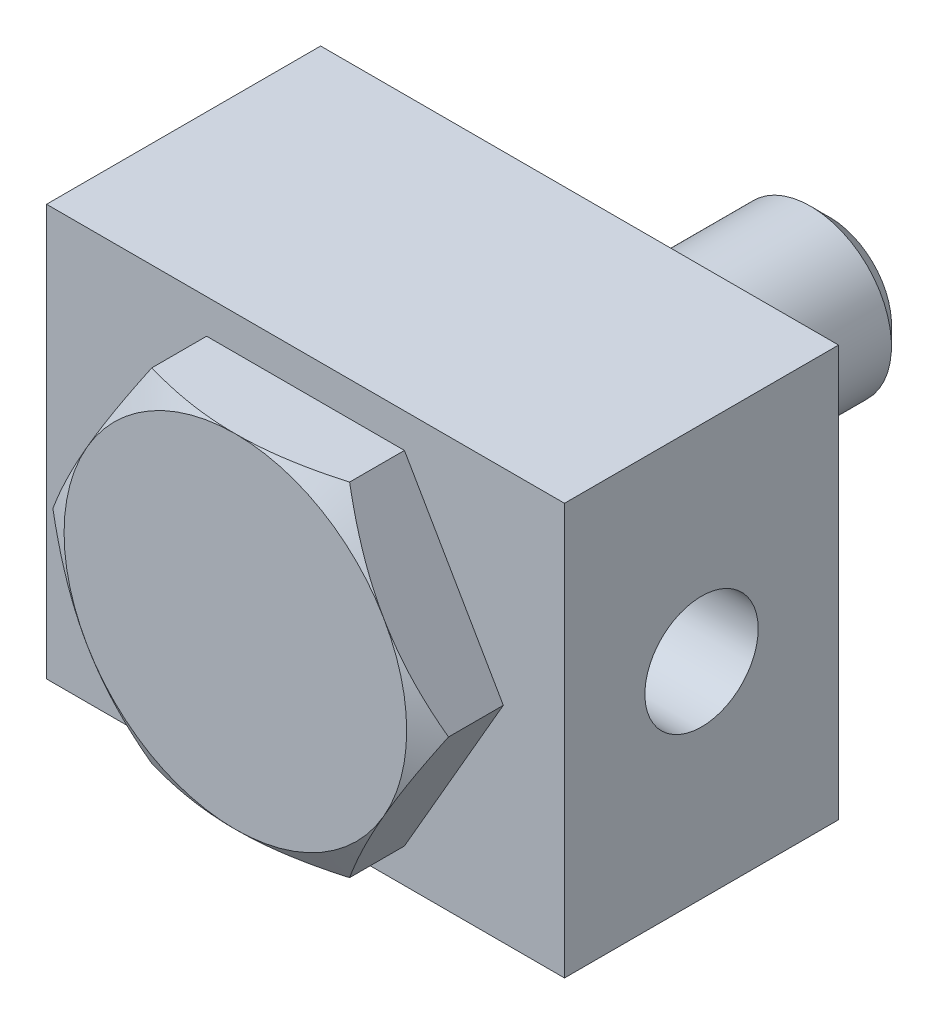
ISO-10303-21;
HEADER;
FILE_DESCRIPTION(('STEP AP214'),'2;1');
FILE_NAME('part.step','',(''),(''),'','','');
FILE_SCHEMA(('AUTOMOTIVE_DESIGN { 1 0 10303 214 1 1 1 1 }'));
ENDSEC;
DATA;
#1=APPLICATION_CONTEXT('core data for automotive mechanical design processes');
#2=APPLICATION_PROTOCOL_DEFINITION('international standard','automotive_design',2000,#1);
#3=PRODUCT_CONTEXT('',#1,'mechanical');
#4=PRODUCT('Part','Part','',(#3));
#5=PRODUCT_RELATED_PRODUCT_CATEGORY('part','',(#4));
#6=PRODUCT_DEFINITION_FORMATION('','',#4);
#7=PRODUCT_DEFINITION_CONTEXT('part definition',#1,'design');
#8=PRODUCT_DEFINITION('design','',#6,#7);
#9=PRODUCT_DEFINITION_SHAPE('','',#8);
#10=(LENGTH_UNIT() NAMED_UNIT(*) SI_UNIT(.MILLI.,.METRE.));
#11=(NAMED_UNIT(*) PLANE_ANGLE_UNIT() SI_UNIT($,.RADIAN.));
#12=(NAMED_UNIT(*) SI_UNIT($,.STERADIAN.) SOLID_ANGLE_UNIT());
#13=UNCERTAINTY_MEASURE_WITH_UNIT(LENGTH_MEASURE(1.E-05),#10,'distance_accuracy_value','');
#14=(GEOMETRIC_REPRESENTATION_CONTEXT(3) GLOBAL_UNCERTAINTY_ASSIGNED_CONTEXT((#13)) GLOBAL_UNIT_ASSIGNED_CONTEXT((#10,
#11,#12)) REPRESENTATION_CONTEXT('',''));
#15=CARTESIAN_POINT('',(0.,0.,0.));
#16=DIRECTION('',(0.,0.,1.));
#17=DIRECTION('',(1.,0.,0.));
#18=AXIS2_PLACEMENT_3D('',#15,#16,#17);
#19=CARTESIAN_POINT('',(-18.3308710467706,31.75,70.3));
#20=DIRECTION('',(0.866025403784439,-0.5,0.));
#21=DIRECTION('',(0.5,0.866025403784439,0.));
#22=AXIS2_PLACEMENT_3D('',#19,#20,#21);
#23=PLANE('',#22);
#24=CARTESIAN_POINT('',(-18.3307555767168,31.7502,62.4641377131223));
#25=CARTESIAN_POINT('',(-18.7336598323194,31.0523493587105,62.6967369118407));
#26=CARTESIAN_POINT('',(-19.13813562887,30.3517767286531,62.9187809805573));
#27=CARTESIAN_POINT('',(-19.9503306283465,28.9450137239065,63.3388249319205));
#28=CARTESIAN_POINT('',(-20.358050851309,28.238821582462,63.5368169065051));
#29=CARTESIAN_POINT('',(-21.1775313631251,26.8194397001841,63.906099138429));
#30=CARTESIAN_POINT('',(-21.5892988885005,26.1062374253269,64.0773256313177));
#31=CARTESIAN_POINT('',(-22.4156776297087,24.6749074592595,64.3893882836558));
#32=CARTESIAN_POINT('',(-22.8302885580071,23.9567802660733,64.5302274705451));
#33=CARTESIAN_POINT('',(-23.6517563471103,22.5339563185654,64.7755371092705));
#34=CARTESIAN_POINT('',(-24.0585522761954,21.8293651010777,64.8808188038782));
#35=CARTESIAN_POINT('',(-24.8740080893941,20.4169542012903,65.0573518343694));
#36=CARTESIAN_POINT('',(-25.2826680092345,19.7091344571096,65.1286025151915));
#37=CARTESIAN_POINT('',(-26.100674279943,18.2923060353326,65.2352744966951));
#38=CARTESIAN_POINT('',(-26.5100192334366,17.5832997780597,65.2707383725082));
#39=CARTESIAN_POINT('',(-27.3290869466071,16.1646328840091,65.3050740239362));
#40=CARTESIAN_POINT('',(-27.7388096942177,15.4549722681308,65.3039469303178));
#41=CARTESIAN_POINT('',(-28.5047899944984,14.1282554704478,65.2676569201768));
#42=CARTESIAN_POINT('',(-28.8611021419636,13.5111047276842,65.2369192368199));
#43=CARTESIAN_POINT('',(-29.5728766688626,12.2782750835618,65.1483534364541));
#44=CARTESIAN_POINT('',(-29.9283390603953,11.6625961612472,65.0905257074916));
#45=CARTESIAN_POINT('',(-30.6382785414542,10.4329449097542,64.9487854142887));
#46=CARTESIAN_POINT('',(-30.9927544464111,9.81897463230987,64.8648492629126));
#47=CARTESIAN_POINT('',(-31.7000213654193,8.59395239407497,64.6723649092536));
#48=CARTESIAN_POINT('',(-32.0528123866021,7.98290042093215,64.5638168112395));
#49=CARTESIAN_POINT('',(-32.7641994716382,6.75074184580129,64.3211744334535));
#50=CARTESIAN_POINT('',(-33.1227517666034,6.12971105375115,64.186569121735));
#51=CARTESIAN_POINT('',(-33.8376618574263,4.89145045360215,63.895403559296));
#52=CARTESIAN_POINT('',(-34.1940193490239,4.27422117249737,63.7388403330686));
#53=CARTESIAN_POINT('',(-34.9037042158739,3.04501092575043,63.4061282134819));
#54=CARTESIAN_POINT('',(-35.2570361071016,2.43302213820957,63.2300176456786));
#55=CARTESIAN_POINT('',(-35.9612560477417,1.21327742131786,62.8599677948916));
#56=CARTESIAN_POINT('',(-36.3121447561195,0.605520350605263,62.6660335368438));
#57=CARTESIAN_POINT('',(-36.6618575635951,-0.000200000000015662,62.4641377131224));
#58=B_SPLINE_CURVE_WITH_KNOTS('',3,(#24,#25,#26,#27,#28,#29,#30,#31,#32,#33,#34,#35,#36,#37,#38,
#39,#40,#41,#42,#43,#44,#45,#46,#47,#48,#49,#50,#51,#52,#53,#54,#55,#56,#57),.UNSPECIFIED.,.F.,
.F.,(4,2,2,2,2,2,2,2,2,2,2,2,2,2,2,2,4),(0.,2.51618738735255,5.03319984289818,7.55612017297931,
10.078789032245,12.5392457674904,14.999749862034,17.4573232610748,19.9148207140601,
22.0541658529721,24.1934803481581,26.3347332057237,28.4759769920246,30.6644883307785,
32.8532965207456,35.0378865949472,37.2218626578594),.UNSPECIFIED.);
#59=CARTESIAN_POINT('',(-18.3308710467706,31.75,62.464204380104));
#60=VERTEX_POINT('',#59);
#61=CARTESIAN_POINT('',(-27.496306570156,15.875,65.3));
#62=VERTEX_POINT('',#61);
#63=EDGE_CURVE('E110',#60,#62,#58,.T.);
#64=ORIENTED_EDGE('',*,*,#63,.F.);
#65=DIRECTION('',(0.,0.,-1.));
#66=VECTOR('',#65,1.);
#67=CARTESIAN_POINT('',(-18.3308710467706,31.75,70.3));
#68=LINE('',#67,#66);
#69=CARTESIAN_POINT('',(-18.3308710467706,31.75,52.3));
#70=VERTEX_POINT('',#69);
#71=EDGE_CURVE('E387',#60,#70,#68,.T.);
#72=ORIENTED_EDGE('',*,*,#71,.T.);
#73=DIRECTION('',(-0.5,-0.866025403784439,0.));
#74=VECTOR('',#73,1.);
#75=CARTESIAN_POINT('',(-18.3308710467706,31.75,52.3));
#76=LINE('',#75,#74);
#77=CARTESIAN_POINT('',(-36.6617420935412,0.,52.3));
#78=VERTEX_POINT('',#77);
#79=EDGE_CURVE('E119',#70,#78,#76,.T.);
#80=ORIENTED_EDGE('',*,*,#79,.T.);
#81=DIRECTION('',(0.,0.,-1.));
#82=VECTOR('',#81,1.);
#83=CARTESIAN_POINT('',(-36.6617420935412,0.,70.3));
#84=LINE('',#83,#82);
#85=CARTESIAN_POINT('',(-36.6617420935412,0.,62.464204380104));
#86=VERTEX_POINT('',#85);
#87=EDGE_CURVE('E138',#86,#78,#84,.T.);
#88=ORIENTED_EDGE('',*,*,#87,.F.);
#89=EDGE_CURVE('E120',#62,#86,#58,.T.);
#90=ORIENTED_EDGE('',*,*,#89,.F.);
#91=EDGE_LOOP('',(#64,#72,#80,#88,#90));
#92=FACE_BOUND('',#91,.T.);
#93=ADVANCED_FACE('F16',(#92),#23,.F.);
#94=CARTESIAN_POINT('',(-36.6617420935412,0.,70.3));
#95=DIRECTION('',(0.866025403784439,0.5,0.));
#96=DIRECTION('',(-0.5,0.866025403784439,0.));
#97=AXIS2_PLACEMENT_3D('',#94,#95,#96);
#98=PLANE('',#97);
#99=CARTESIAN_POINT('',(-36.6618575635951,0.000199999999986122,62.4641377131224));
#100=CARTESIAN_POINT('',(-36.2589533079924,-0.69765064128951,62.6967369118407));
#101=CARTESIAN_POINT('',(-35.8544775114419,-1.39822327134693,62.9187809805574));
#102=CARTESIAN_POINT('',(-35.0422825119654,-2.80498627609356,63.3388249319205));
#103=CARTESIAN_POINT('',(-34.6345622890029,-3.51117841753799,63.5368169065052));
#104=CARTESIAN_POINT('',(-33.8150817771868,-4.93056029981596,63.906099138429));
#105=CARTESIAN_POINT('',(-33.4033142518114,-5.64376257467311,64.0773256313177));
#106=CARTESIAN_POINT('',(-32.5769355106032,-7.07509254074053,64.3893882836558));
#107=CARTESIAN_POINT('',(-32.1623245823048,-7.79321973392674,64.5302274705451));
#108=CARTESIAN_POINT('',(-31.3408567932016,-9.21604368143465,64.7755371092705));
#109=CARTESIAN_POINT('',(-30.9340608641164,-9.92063489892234,64.8808188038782));
#110=CARTESIAN_POINT('',(-30.1186050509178,-11.3330457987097,65.0573518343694));
#111=CARTESIAN_POINT('',(-29.7099451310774,-12.0408655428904,65.1286025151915));
#112=CARTESIAN_POINT('',(-28.8919388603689,-13.4576939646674,65.2352744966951));
#113=CARTESIAN_POINT('',(-28.4825939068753,-14.1667002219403,65.2707383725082));
#114=CARTESIAN_POINT('',(-27.6635261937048,-15.5853671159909,65.3050740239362));
#115=CARTESIAN_POINT('',(-27.2538034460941,-16.2950277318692,65.3039469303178));
#116=CARTESIAN_POINT('',(-26.4878231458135,-17.6217445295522,65.2676569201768));
#117=CARTESIAN_POINT('',(-26.1315109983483,-18.2388952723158,65.2369192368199));
#118=CARTESIAN_POINT('',(-25.4197364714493,-19.4717249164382,65.1483534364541));
#119=CARTESIAN_POINT('',(-25.0642740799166,-20.0874038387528,65.0905257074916));
#120=CARTESIAN_POINT('',(-24.3543345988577,-21.3170550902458,64.9487854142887));
#121=CARTESIAN_POINT('',(-23.9998586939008,-21.9310253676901,64.8648492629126));
#122=CARTESIAN_POINT('',(-23.2925917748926,-23.156047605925,64.6723649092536));
#123=CARTESIAN_POINT('',(-22.9398007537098,-23.7670995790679,64.5638168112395));
#124=CARTESIAN_POINT('',(-22.2284136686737,-24.9992581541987,64.3211744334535));
#125=CARTESIAN_POINT('',(-21.8698613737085,-25.6202889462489,64.1865691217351));
#126=CARTESIAN_POINT('',(-21.1549512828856,-26.8585495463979,63.895403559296));
#127=CARTESIAN_POINT('',(-20.798593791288,-27.4757788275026,63.7388403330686));
#128=CARTESIAN_POINT('',(-20.088908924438,-28.7049890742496,63.4061282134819));
#129=CARTESIAN_POINT('',(-19.7355770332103,-29.3169778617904,63.2300176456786));
#130=CARTESIAN_POINT('',(-19.0313570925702,-30.5367225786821,62.8599677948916));
#131=CARTESIAN_POINT('',(-18.6804683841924,-31.1444796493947,62.6660335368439));
#132=CARTESIAN_POINT('',(-18.3307555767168,-31.7502,62.4641377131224));
#133=B_SPLINE_CURVE_WITH_KNOTS('',3,(#99,#100,#101,#102,#103,#104,#105,#106,#107,#108,#109,#110,
#111,#112,#113,#114,#115,#116,#117,#118,#119,#120,#121,#122,#123,#124,#125,#126,#127,#128,#129,
#130,#131,#132),.UNSPECIFIED.,.F.,.F.,(4,2,2,2,2,2,2,2,2,2,2,2,2,2,2,2,4),(0.,2.51618738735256,
5.03319984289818,7.5561201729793,10.078789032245,12.5392457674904,14.999749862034,
17.4573232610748,19.9148207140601,22.054165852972,24.193480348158,26.3347332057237,
28.4759769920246,30.6644883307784,32.8532965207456,35.0378865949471,37.2218626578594),.UNSPECIFIED.);
#134=CARTESIAN_POINT('',(-27.496306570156,-15.875,65.3));
#135=VERTEX_POINT('',#134);
#136=EDGE_CURVE('E127',#86,#135,#133,.T.);
#137=ORIENTED_EDGE('',*,*,#136,.F.);
#138=ORIENTED_EDGE('',*,*,#87,.T.);
#139=DIRECTION('',(0.5,-0.866025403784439,0.));
#140=VECTOR('',#139,1.);
#141=CARTESIAN_POINT('',(-36.6617420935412,0.,52.3));
#142=LINE('',#141,#140);
#143=CARTESIAN_POINT('',(-18.3308710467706,-31.75,52.3));
#144=VERTEX_POINT('',#143);
#145=EDGE_CURVE('E395',#78,#144,#142,.T.);
#146=ORIENTED_EDGE('',*,*,#145,.T.);
#147=DIRECTION('',(0.,0.,-1.));
#148=VECTOR('',#147,1.);
#149=CARTESIAN_POINT('',(-18.3308710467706,-31.75,70.3));
#150=LINE('',#149,#148);
#151=CARTESIAN_POINT('',(-18.3308710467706,-31.75,62.464204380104));
#152=VERTEX_POINT('',#151);
#153=EDGE_CURVE('E216',#152,#144,#150,.T.);
#154=ORIENTED_EDGE('',*,*,#153,.F.);
#155=EDGE_CURVE('E139',#135,#152,#133,.T.);
#156=ORIENTED_EDGE('',*,*,#155,.F.);
#157=EDGE_LOOP('',(#137,#138,#146,#154,#156));
#158=FACE_BOUND('',#157,.T.);
#159=ADVANCED_FACE('F202',(#158),#98,.F.);
#160=CARTESIAN_POINT('',(-18.3308710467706,-31.75,70.3));
#161=DIRECTION('',(0.,1.,0.));
#162=DIRECTION('',(-1.,0.,0.));
#163=AXIS2_PLACEMENT_3D('',#160,#161,#162);
#164=PLANE('',#163);
#165=CARTESIAN_POINT('',(-49.0609987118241,-31.75,49.8914574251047));
#166=CARTESIAN_POINT('',(-48.3684107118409,-31.75,50.2271485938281));
#167=CARTESIAN_POINT('',(-47.6750046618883,-31.75,50.5611570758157));
#168=CARTESIAN_POINT('',(-46.2863868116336,-31.75,51.2254164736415));
#169=CARTESIAN_POINT('',(-45.5911749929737,-31.75,51.5556673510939));
#170=CARTESIAN_POINT('',(-44.1986810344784,-31.75,52.2120638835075));
#171=CARTESIAN_POINT('',(-43.5013985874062,-31.75,52.5382088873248));
#172=CARTESIAN_POINT('',(-42.1046897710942,-31.75,53.1858689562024));
#173=CARTESIAN_POINT('',(-41.4052634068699,-31.75,53.5073840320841));
#174=CARTESIAN_POINT('',(-39.29574648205,-31.75,54.4677329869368));
#175=CARTESIAN_POINT('',(-37.8820802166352,-31.75,55.0987453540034));
#176=CARTESIAN_POINT('',(-35.0434372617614,-31.75,56.3347449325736));
#177=CARTESIAN_POINT('',(-33.6184611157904,-31.75,56.9397333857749));
#178=CARTESIAN_POINT('',(-31.4481556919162,-31.75,57.8317691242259));
#179=CARTESIAN_POINT('',(-30.7078021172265,-31.75,58.1309335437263));
#180=CARTESIAN_POINT('',(-29.2231292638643,-31.75,58.7192803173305));
#181=CARTESIAN_POINT('',(-28.4788099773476,-31.75,59.008462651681));
#182=CARTESIAN_POINT('',(-26.9857641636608,-31.75,59.5755330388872));
#183=CARTESIAN_POINT('',(-26.2370370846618,-31.75,59.8534196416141));
#184=CARTESIAN_POINT('',(-24.7349201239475,-31.75,60.3963012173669));
#185=CARTESIAN_POINT('',(-23.9815302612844,-31.75,60.6612962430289));
#186=CARTESIAN_POINT('',(-22.4712971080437,-31.75,61.1760941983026));
#187=CARTESIAN_POINT('',(-21.7144642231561,-31.75,61.4259275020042));
#188=CARTESIAN_POINT('',(-20.1955328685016,-31.75,61.90898962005));
#189=CARTESIAN_POINT('',(-19.4334343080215,-31.75,62.1422181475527));
#190=CARTESIAN_POINT('',(-17.1392161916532,-31.75,62.8136001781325));
#191=CARTESIAN_POINT('',(-15.5985913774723,-31.75,63.2236522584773));
#192=CARTESIAN_POINT('',(-13.2752970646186,-31.75,63.7663407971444));
#193=CARTESIAN_POINT('',(-12.5009089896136,-31.75,63.9348146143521));
#194=CARTESIAN_POINT('',(-10.9468685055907,-31.75,64.2456093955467));
#195=CARTESIAN_POINT('',(-10.1672162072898,-31.75,64.3879309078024));
#196=CARTESIAN_POINT('',(-8.60321979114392,-31.75,64.6438959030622));
#197=CARTESIAN_POINT('',(-7.81887581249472,-31.75,64.7575402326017));
#198=CARTESIAN_POINT('',(-6.24629654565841,-31.75,64.953884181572));
#199=CARTESIAN_POINT('',(-5.4580612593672,-31.75,65.036583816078));
#200=CARTESIAN_POINT('',(-3.88905799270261,-31.75,65.1683616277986));
#201=CARTESIAN_POINT('',(-3.10832565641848,-31.75,65.2178617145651));
#202=CARTESIAN_POINT('',(-1.54546751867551,-31.75,65.2838124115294));
#203=CARTESIAN_POINT('',(-0.763341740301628,-31.75,65.3002635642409));
#204=CARTESIAN_POINT('',(0.80090033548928,-31.75,65.2997300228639));
#205=CARTESIAN_POINT('',(1.58301663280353,-31.75,65.2827450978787));
#206=CARTESIAN_POINT('',(3.14586968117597,-31.75,65.215734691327));
#207=CARTESIAN_POINT('',(3.92660636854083,-31.75,65.1657077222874));
#208=CARTESIAN_POINT('',(5.25717405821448,-31.75,65.0530813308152));
#209=CARTESIAN_POINT('',(5.80769556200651,-31.75,64.9984491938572));
#210=CARTESIAN_POINT('',(6.90700558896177,-31.75,64.8738397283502));
#211=CARTESIAN_POINT('',(7.45579406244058,-31.75,64.8038619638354));
#212=CARTESIAN_POINT('',(9.09913998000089,-31.75,64.5719348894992));
#213=CARTESIAN_POINT('',(10.1906479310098,-31.75,64.3879944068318));
#214=CARTESIAN_POINT('',(12.3643105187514,-31.75,63.96798055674));
#215=CARTESIAN_POINT('',(13.4464570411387,-31.75,63.7318659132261));
#216=CARTESIAN_POINT('',(15.5998610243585,-31.75,63.2147070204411));
#217=CARTESIAN_POINT('',(16.6711186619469,-31.75,62.9336635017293));
#218=CARTESIAN_POINT('',(18.8260878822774,-31.75,62.3268831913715));
#219=CARTESIAN_POINT('',(19.9095606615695,-31.75,62.0003045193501));
#220=CARTESIAN_POINT('',(22.065830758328,-31.75,61.3138040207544));
#221=CARTESIAN_POINT('',(23.1386280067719,-31.75,60.9538819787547));
#222=CARTESIAN_POINT('',(25.2740913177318,-31.75,60.2063728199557));
#223=CARTESIAN_POINT('',(26.3367607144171,-31.75,59.8187951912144));
#224=CARTESIAN_POINT('',(27.9241682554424,-31.75,59.22007093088));
#225=CARTESIAN_POINT('',(28.452204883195,-31.75,59.0176031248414));
#226=CARTESIAN_POINT('',(29.5062159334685,-31.75,58.6073631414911));
#227=CARTESIAN_POINT('',(30.0321903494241,-31.75,58.399590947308));
#228=CARTESIAN_POINT('',(31.941261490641,-31.75,57.6352911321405));
#229=CARTESIAN_POINT('',(33.3186160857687,-31.75,57.064387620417));
#230=CARTESIAN_POINT('',(36.0620094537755,-31.75,55.8959695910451));
#231=CARTESIAN_POINT('',(37.4280475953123,-31.75,55.2984536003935));
#232=CARTESIAN_POINT('',(40.1508563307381,-31.75,54.081983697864));
#233=CARTESIAN_POINT('',(41.5076249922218,-31.75,53.4630254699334));
#234=CARTESIAN_POINT('',(44.2131157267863,-31.75,52.2078748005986));
#235=CARTESIAN_POINT('',(45.561837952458,-31.75,51.5716826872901));
#236=CARTESIAN_POINT('',(48.2539031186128,-31.75,50.2845467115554));
#237=CARTESIAN_POINT('',(49.5972391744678,-31.75,49.6335884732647));
#238=CARTESIAN_POINT('',(52.2781978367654,-31.75,48.3200139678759));
#239=CARTESIAN_POINT('',(53.6158204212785,-31.75,47.6573976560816));
#240=CARTESIAN_POINT('',(56.2860541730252,-31.75,46.3225321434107));
#241=CARTESIAN_POINT('',(57.6186658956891,-31.75,45.6502840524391));
#242=CARTESIAN_POINT('',(60.2797370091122,-31.75,44.2976313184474));
#243=CARTESIAN_POINT('',(61.6081964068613,-31.75,43.6172266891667));
#244=CARTESIAN_POINT('',(64.1545838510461,-31.75,42.3046429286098));
#245=CARTESIAN_POINT('',(65.3727877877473,-31.75,41.6729986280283));
#246=CARTESIAN_POINT('',(67.8065601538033,-31.75,40.4046512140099));
#247=CARTESIAN_POINT('',(69.0221285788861,-31.75,39.7679480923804));
#248=CARTESIAN_POINT('',(72.6654502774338,-31.75,37.8512322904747));
#249=CARTESIAN_POINT('',(75.0897489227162,-31.75,36.5646499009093));
#250=CARTESIAN_POINT('',(78.7179557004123,-31.75,34.6262068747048));
#251=CARTESIAN_POINT('',(79.924569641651,-31.75,33.979396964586));
#252=CARTESIAN_POINT('',(82.3361973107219,-31.75,32.6827982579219));
#253=CARTESIAN_POINT('',(83.5412110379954,-31.75,32.0330094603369));
#254=CARTESIAN_POINT('',(85.9497498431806,-31.75,30.7308286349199));
#255=CARTESIAN_POINT('',(87.153274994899,-31.75,30.0784367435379));
#256=CARTESIAN_POINT('',(89.5590411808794,-31.75,28.7712938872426));
#257=CARTESIAN_POINT('',(90.7612822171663,-31.75,28.1165429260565));
#258=CARTESIAN_POINT('',(91.9629541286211,-31.75,27.4607501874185));
#259=B_SPLINE_CURVE_WITH_KNOTS('',3,(#165,#166,#167,#168,#169,#170,#171,#172,#173,#174,#175,
#176,#177,#178,#179,#180,#181,#182,#183,#184,#185,#186,#187,#188,#189,#190,#191,#192,#193,#194,
#195,#196,#197,#198,#199,#200,#201,#202,#203,#204,#205,#206,#207,#208,#209,#210,#211,#212,#213,
#214,#215,#216,#217,#218,#219,#220,#221,#222,#223,#224,#225,#226,#227,#228,#229,#230,#231,#232,
#233,#234,#235,#236,#237,#238,#239,#240,#241,#242,#243,#244,#245,#246,#247,#248,#249,#250,#251,
#252,#253,#254,#255,#256,#257,#258),.UNSPECIFIED.,.F.,.F.,(4,2,2,2,2,2,2,2,2,2,2,2,2,2,2,2,2,2,
2,2,2,2,2,2,2,2,2,2,2,2,2,2,2,2,2,2,2,2,2,2,2,2,2,2,2,2,4),(0.,2.30896175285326,
4.61794707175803,6.92729406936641,9.23663566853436,13.8807459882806,18.5246344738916,
20.9201141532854,23.3155985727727,25.7113895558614,28.1071707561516,30.4979821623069,
32.8888348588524,37.668691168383,40.0458440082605,42.4229470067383,44.7999798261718,
47.1770114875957,49.5232318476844,51.8694136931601,54.2156117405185,56.5619154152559,
58.2213801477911,59.8808920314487,63.2000059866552,66.5217552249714,69.8434504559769,
73.2376744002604,76.6319202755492,80.025007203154,81.721552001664,83.4181021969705,
87.890651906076,92.3634494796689,96.8371526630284,101.310770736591,105.788948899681,
110.267144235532,114.744827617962,119.222503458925,123.339158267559,127.455819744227,
135.689382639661,139.796511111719,143.903641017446,148.01055839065,152.117469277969),.UNSPECIFIED.);
#260=CARTESIAN_POINT('',(0.,-31.75,65.3));
#261=VERTEX_POINT('',#260);
#262=EDGE_CURVE('E196',#152,#261,#259,.T.);
#263=ORIENTED_EDGE('',*,*,#262,.F.);
#264=ORIENTED_EDGE('',*,*,#153,.T.);
#265=DIRECTION('',(1.,0.,0.));
#266=VECTOR('',#265,1.);
#267=CARTESIAN_POINT('',(-18.3308710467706,-31.75,52.3));
#268=LINE('',#267,#266);
#269=CARTESIAN_POINT('',(18.3308710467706,-31.75,52.3));
#270=VERTEX_POINT('',#269);
#271=EDGE_CURVE('E234',#144,#270,#268,.T.);
#272=ORIENTED_EDGE('',*,*,#271,.T.);
#273=DIRECTION('',(0.,0.,-1.));
#274=VECTOR('',#273,1.);
#275=CARTESIAN_POINT('',(18.3308710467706,-31.75,70.3));
#276=LINE('',#275,#274);
#277=CARTESIAN_POINT('',(18.3308710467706,-31.75,62.464204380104));
#278=VERTEX_POINT('',#277);
#279=EDGE_CURVE('E232',#278,#270,#276,.T.);
#280=ORIENTED_EDGE('',*,*,#279,.F.);
#281=EDGE_CURVE('E190',#261,#278,#259,.T.);
#282=ORIENTED_EDGE('',*,*,#281,.F.);
#283=EDGE_LOOP('',(#263,#264,#272,#280,#282));
#284=FACE_BOUND('',#283,.T.);
#285=ADVANCED_FACE('F198',(#284),#164,.F.);
#286=CARTESIAN_POINT('',(18.3308710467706,-31.75,70.3));
#287=DIRECTION('',(-0.866025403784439,0.5,0.));
#288=DIRECTION('',(-0.5,-0.866025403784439,0.));
#289=AXIS2_PLACEMENT_3D('',#286,#287,#288);
#290=PLANE('',#289);
#291=CARTESIAN_POINT('',(18.3307555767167,-31.7502,62.4641377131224));
#292=CARTESIAN_POINT('',(18.7336598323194,-31.0523493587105,62.6967369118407));
#293=CARTESIAN_POINT('',(19.1381356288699,-30.3517767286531,62.9187809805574));
#294=CARTESIAN_POINT('',(19.9503306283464,-28.9450137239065,63.3388249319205));
#295=CARTESIAN_POINT('',(20.358050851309,-28.238821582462,63.5368169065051));
#296=CARTESIAN_POINT('',(21.177531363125,-26.8194397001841,63.9060991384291));
#297=CARTESIAN_POINT('',(21.5892988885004,-26.1062374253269,64.0773256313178));
#298=CARTESIAN_POINT('',(22.4156776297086,-24.6749074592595,64.3893882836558));
#299=CARTESIAN_POINT('',(22.8302885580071,-23.9567802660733,64.5302274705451));
#300=CARTESIAN_POINT('',(23.6517563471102,-22.5339563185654,64.7755371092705));
#301=CARTESIAN_POINT('',(24.0585522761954,-21.8293651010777,64.8808188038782));
#302=CARTESIAN_POINT('',(24.874008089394,-20.4169542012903,65.0573518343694));
#303=CARTESIAN_POINT('',(25.2826680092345,-19.7091344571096,65.1286025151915));
#304=CARTESIAN_POINT('',(26.1006742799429,-18.2923060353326,65.2352744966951));
#305=CARTESIAN_POINT('',(26.5100192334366,-17.5832997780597,65.2707383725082));
#306=CARTESIAN_POINT('',(27.3290869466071,-16.1646328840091,65.3050740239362));
#307=CARTESIAN_POINT('',(27.7388096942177,-15.4549722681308,65.3039469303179));
#308=CARTESIAN_POINT('',(28.5047899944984,-14.1282554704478,65.2676569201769));
#309=CARTESIAN_POINT('',(28.8611021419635,-13.5111047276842,65.2369192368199));
#310=CARTESIAN_POINT('',(29.5728766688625,-12.2782750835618,65.1483534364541));
#311=CARTESIAN_POINT('',(29.9283390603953,-11.6625961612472,65.0905257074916));
#312=CARTESIAN_POINT('',(30.6382785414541,-10.4329449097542,64.9487854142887));
#313=CARTESIAN_POINT('',(30.992754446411,-9.81897463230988,64.8648492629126));
#314=CARTESIAN_POINT('',(31.7000213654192,-8.59395239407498,64.6723649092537));
#315=CARTESIAN_POINT('',(32.0528123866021,-7.98290042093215,64.5638168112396));
#316=CARTESIAN_POINT('',(32.7641994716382,-6.75074184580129,64.3211744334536));
#317=CARTESIAN_POINT('',(33.1227517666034,-6.12971105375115,64.1865691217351));
#318=CARTESIAN_POINT('',(33.8376618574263,-4.89145045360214,63.895403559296));
#319=CARTESIAN_POINT('',(34.1940193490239,-4.27422117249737,63.7388403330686));
#320=CARTESIAN_POINT('',(34.9037042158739,-3.04501092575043,63.406128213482));
#321=CARTESIAN_POINT('',(35.2570361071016,-2.43302213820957,63.2300176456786));
#322=CARTESIAN_POINT('',(35.9612560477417,-1.21327742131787,62.8599677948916));
#323=CARTESIAN_POINT('',(36.3121447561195,-0.605520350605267,62.6660335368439));
#324=CARTESIAN_POINT('',(36.661857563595,0.000200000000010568,62.4641377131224));
#325=B_SPLINE_CURVE_WITH_KNOTS('',3,(#291,#292,#293,#294,#295,#296,#297,#298,#299,#300,#301,
#302,#303,#304,#305,#306,#307,#308,#309,#310,#311,#312,#313,#314,#315,#316,#317,#318,#319,#320,
#321,#322,#323,#324),.UNSPECIFIED.,.F.,.F.,(4,2,2,2,2,2,2,2,2,2,2,2,2,2,2,2,4),(0.,
2.51618738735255,5.03319984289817,7.5561201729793,10.078789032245,12.5392457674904,
14.999749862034,17.4573232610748,19.9148207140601,22.054165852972,24.193480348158,
26.3347332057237,28.4759769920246,30.6644883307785,32.8532965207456,35.0378865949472,
37.2218626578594),.UNSPECIFIED.);
#326=CARTESIAN_POINT('',(27.496306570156,-15.875,65.3));
#327=VERTEX_POINT('',#326);
#328=EDGE_CURVE('E197',#278,#327,#325,.T.);
#329=ORIENTED_EDGE('',*,*,#328,.F.);
#330=ORIENTED_EDGE('',*,*,#279,.T.);
#331=DIRECTION('',(0.5,0.866025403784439,0.));
#332=VECTOR('',#331,1.);
#333=CARTESIAN_POINT('',(18.3308710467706,-31.75,52.3));
#334=LINE('',#333,#332);
#335=CARTESIAN_POINT('',(36.6617420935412,0.,52.3));
#336=VERTEX_POINT('',#335);
#337=EDGE_CURVE('E393',#270,#336,#334,.T.);
#338=ORIENTED_EDGE('',*,*,#337,.T.);
#339=DIRECTION('',(0.,0.,-1.));
#340=VECTOR('',#339,1.);
#341=CARTESIAN_POINT('',(36.6617420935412,0.,70.3));
#342=LINE('',#341,#340);
#343=CARTESIAN_POINT('',(36.6617420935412,0.,62.464204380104));
#344=VERTEX_POINT('',#343);
#345=EDGE_CURVE('E238',#344,#336,#342,.T.);
#346=ORIENTED_EDGE('',*,*,#345,.F.);
#347=EDGE_CURVE('E184',#327,#344,#325,.T.);
#348=ORIENTED_EDGE('',*,*,#347,.F.);
#349=EDGE_LOOP('',(#329,#330,#338,#346,#348));
#350=FACE_BOUND('',#349,.T.);
#351=ADVANCED_FACE('F201',(#350),#290,.F.);
#352=CARTESIAN_POINT('',(36.6617420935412,0.,70.3));
#353=DIRECTION('',(-0.866025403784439,-0.5,0.));
#354=DIRECTION('',(0.5,-0.866025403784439,0.));
#355=AXIS2_PLACEMENT_3D('',#352,#353,#354);
#356=PLANE('',#355);
#357=CARTESIAN_POINT('',(36.661857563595,-0.000199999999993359,62.4641377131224));
#358=CARTESIAN_POINT('',(36.2589533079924,0.697650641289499,62.6967369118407));
#359=CARTESIAN_POINT('',(35.8544775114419,1.39822327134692,62.9187809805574));
#360=CARTESIAN_POINT('',(35.0422825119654,2.80498627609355,63.3388249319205));
#361=CARTESIAN_POINT('',(34.6345622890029,3.51117841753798,63.5368169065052));
#362=CARTESIAN_POINT('',(33.8150817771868,4.93056029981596,63.9060991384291));
#363=CARTESIAN_POINT('',(33.4033142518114,5.6437625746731,64.0773256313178));
#364=CARTESIAN_POINT('',(32.5769355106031,7.07509254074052,64.3893882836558));
#365=CARTESIAN_POINT('',(32.1623245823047,7.79321973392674,64.5302274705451));
#366=CARTESIAN_POINT('',(31.3408567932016,9.21604368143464,64.7755371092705));
#367=CARTESIAN_POINT('',(30.9340608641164,9.92063489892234,64.8808188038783));
#368=CARTESIAN_POINT('',(30.1186050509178,11.3330457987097,65.0573518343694));
#369=CARTESIAN_POINT('',(29.7099451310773,12.0408655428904,65.1286025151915));
#370=CARTESIAN_POINT('',(28.8919388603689,13.4576939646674,65.2352744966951));
#371=CARTESIAN_POINT('',(28.4825939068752,14.1667002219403,65.2707383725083));
#372=CARTESIAN_POINT('',(27.6635261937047,15.5853671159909,65.3050740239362));
#373=CARTESIAN_POINT('',(27.2538034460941,16.2950277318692,65.3039469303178));
#374=CARTESIAN_POINT('',(26.4878231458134,17.6217445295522,65.2676569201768));
#375=CARTESIAN_POINT('',(26.1315109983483,18.2388952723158,65.2369192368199));
#376=CARTESIAN_POINT('',(25.4197364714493,19.4717249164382,65.1483534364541));
#377=CARTESIAN_POINT('',(25.0642740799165,20.0874038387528,65.0905257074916));
#378=CARTESIAN_POINT('',(24.3543345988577,21.3170550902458,64.9487854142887));
#379=CARTESIAN_POINT('',(23.9998586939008,21.9310253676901,64.8648492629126));
#380=CARTESIAN_POINT('',(23.2925917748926,23.156047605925,64.6723649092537));
#381=CARTESIAN_POINT('',(22.9398007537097,23.7670995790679,64.5638168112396));
#382=CARTESIAN_POINT('',(22.2284136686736,24.9992581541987,64.3211744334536));
#383=CARTESIAN_POINT('',(21.8698613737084,25.6202889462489,64.1865691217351));
#384=CARTESIAN_POINT('',(21.1549512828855,26.8585495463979,63.895403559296));
#385=CARTESIAN_POINT('',(20.7985937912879,27.4757788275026,63.7388403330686));
#386=CARTESIAN_POINT('',(20.088908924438,28.7049890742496,63.406128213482));
#387=CARTESIAN_POINT('',(19.7355770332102,29.3169778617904,63.2300176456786));
#388=CARTESIAN_POINT('',(19.0313570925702,30.5367225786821,62.8599677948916));
#389=CARTESIAN_POINT('',(18.6804683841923,31.1444796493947,62.6660335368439));
#390=CARTESIAN_POINT('',(18.3307555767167,31.7502,62.4641377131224));
#391=B_SPLINE_CURVE_WITH_KNOTS('',3,(#357,#358,#359,#360,#361,#362,#363,#364,#365,#366,#367,
#368,#369,#370,#371,#372,#373,#374,#375,#376,#377,#378,#379,#380,#381,#382,#383,#384,#385,#386,
#387,#388,#389,#390),.UNSPECIFIED.,.F.,.F.,(4,2,2,2,2,2,2,2,2,2,2,2,2,2,2,2,4),(0.,
2.51618738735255,5.03319984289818,7.5561201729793,10.078789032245,12.5392457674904,
14.999749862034,17.4573232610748,19.9148207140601,22.0541658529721,24.1934803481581,
26.3347332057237,28.4759769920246,30.6644883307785,32.8532965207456,35.0378865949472,
37.2218626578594),.UNSPECIFIED.);
#392=CARTESIAN_POINT('',(27.496306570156,15.875,65.3));
#393=VERTEX_POINT('',#392);
#394=EDGE_CURVE('E398',#344,#393,#391,.T.);
#395=ORIENTED_EDGE('',*,*,#394,.F.);
#396=ORIENTED_EDGE('',*,*,#345,.T.);
#397=DIRECTION('',(-0.5,0.866025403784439,0.));
#398=VECTOR('',#397,1.);
#399=CARTESIAN_POINT('',(36.6617420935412,0.,52.3));
#400=LINE('',#399,#398);
#401=CARTESIAN_POINT('',(18.3308710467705,31.75,52.3));
#402=VERTEX_POINT('',#401);
#403=EDGE_CURVE('E386',#336,#402,#400,.T.);
#404=ORIENTED_EDGE('',*,*,#403,.T.);
#405=DIRECTION('',(0.,0.,-1.));
#406=VECTOR('',#405,1.);
#407=CARTESIAN_POINT('',(18.3308710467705,31.75,70.3));
#408=LINE('',#407,#406);
#409=CARTESIAN_POINT('',(18.3308710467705,31.75,62.464204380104));
#410=VERTEX_POINT('',#409);
#411=EDGE_CURVE('E241',#410,#402,#408,.T.);
#412=ORIENTED_EDGE('',*,*,#411,.F.);
#413=EDGE_CURVE('E177',#393,#410,#391,.T.);
#414=ORIENTED_EDGE('',*,*,#413,.F.);
#415=EDGE_LOOP('',(#395,#396,#404,#412,#414));
#416=FACE_BOUND('',#415,.T.);
#417=ADVANCED_FACE('F366',(#416),#356,.F.);
#418=CARTESIAN_POINT('',(18.3308710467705,31.75,70.3));
#419=DIRECTION('',(0.,-1.,0.));
#420=DIRECTION('',(0.,0.,-1.));
#421=AXIS2_PLACEMENT_3D('',#418,#419,#420);
#422=PLANE('',#421);
#423=CARTESIAN_POINT('',(-49.0609987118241,31.75,49.8914574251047));
#424=CARTESIAN_POINT('',(-48.3684107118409,31.75,50.2271485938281));
#425=CARTESIAN_POINT('',(-47.6750046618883,31.75,50.5611570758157));
#426=CARTESIAN_POINT('',(-46.2863868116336,31.75,51.2254164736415));
#427=CARTESIAN_POINT('',(-45.5911749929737,31.75,51.5556673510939));
#428=CARTESIAN_POINT('',(-44.1986810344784,31.75,52.2120638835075));
#429=CARTESIAN_POINT('',(-43.5013985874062,31.75,52.5382088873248));
#430=CARTESIAN_POINT('',(-42.1046897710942,31.75,53.1858689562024));
#431=CARTESIAN_POINT('',(-41.4052634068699,31.75,53.5073840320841));
#432=CARTESIAN_POINT('',(-39.29574648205,31.75,54.4677329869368));
#433=CARTESIAN_POINT('',(-37.8820802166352,31.75,55.0987453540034));
#434=CARTESIAN_POINT('',(-35.0434372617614,31.75,56.3347449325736));
#435=CARTESIAN_POINT('',(-33.6184611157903,31.75,56.9397333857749));
#436=CARTESIAN_POINT('',(-31.4481556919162,31.75,57.8317691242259));
#437=CARTESIAN_POINT('',(-30.7078021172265,31.75,58.1309335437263));
#438=CARTESIAN_POINT('',(-29.2231292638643,31.75,58.7192803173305));
#439=CARTESIAN_POINT('',(-28.4788099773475,31.75,59.008462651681));
#440=CARTESIAN_POINT('',(-26.9857641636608,31.75,59.5755330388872));
#441=CARTESIAN_POINT('',(-26.2370370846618,31.75,59.8534196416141));
#442=CARTESIAN_POINT('',(-24.7349201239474,31.75,60.3963012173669));
#443=CARTESIAN_POINT('',(-23.9815302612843,31.75,60.6612962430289));
#444=CARTESIAN_POINT('',(-22.4712971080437,31.75,61.1760941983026));
#445=CARTESIAN_POINT('',(-21.7144642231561,31.75,61.4259275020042));
#446=CARTESIAN_POINT('',(-20.1955328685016,31.75,61.90898962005));
#447=CARTESIAN_POINT('',(-19.4334343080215,31.75,62.1422181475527));
#448=CARTESIAN_POINT('',(-17.1392161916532,31.75,62.8136001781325));
#449=CARTESIAN_POINT('',(-15.5985913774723,31.75,63.2236522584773));
#450=CARTESIAN_POINT('',(-13.2752970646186,31.75,63.7663407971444));
#451=CARTESIAN_POINT('',(-12.5009089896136,31.75,63.9348146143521));
#452=CARTESIAN_POINT('',(-10.9468685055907,31.75,64.2456093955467));
#453=CARTESIAN_POINT('',(-10.1672162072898,31.75,64.3879309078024));
#454=CARTESIAN_POINT('',(-8.60321979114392,31.75,64.6438959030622));
#455=CARTESIAN_POINT('',(-7.81887581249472,31.75,64.7575402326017));
#456=CARTESIAN_POINT('',(-6.24629654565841,31.75,64.953884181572));
#457=CARTESIAN_POINT('',(-5.4580612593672,31.75,65.036583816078));
#458=CARTESIAN_POINT('',(-3.88905799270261,31.75,65.1683616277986));
#459=CARTESIAN_POINT('',(-3.10832565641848,31.75,65.2178617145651));
#460=CARTESIAN_POINT('',(-1.54546751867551,31.75,65.2838124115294));
#461=CARTESIAN_POINT('',(-0.763341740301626,31.75,65.3002635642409));
#462=CARTESIAN_POINT('',(0.800900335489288,31.75,65.2997300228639));
#463=CARTESIAN_POINT('',(1.58301663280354,31.75,65.2827450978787));
#464=CARTESIAN_POINT('',(3.14586968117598,31.75,65.215734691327));
#465=CARTESIAN_POINT('',(3.92660636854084,31.75,65.1657077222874));
#466=CARTESIAN_POINT('',(5.25717405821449,31.75,65.0530813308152));
#467=CARTESIAN_POINT('',(5.80769556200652,31.75,64.9984491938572));
#468=CARTESIAN_POINT('',(6.90700558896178,31.75,64.8738397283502));
#469=CARTESIAN_POINT('',(7.45579406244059,31.75,64.8038619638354));
#470=CARTESIAN_POINT('',(9.09913998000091,31.75,64.5719348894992));
#471=CARTESIAN_POINT('',(10.1906479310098,31.75,64.3879944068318));
#472=CARTESIAN_POINT('',(12.3643105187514,31.75,63.96798055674));
#473=CARTESIAN_POINT('',(13.4464570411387,31.75,63.7318659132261));
#474=CARTESIAN_POINT('',(15.5998610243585,31.75,63.2147070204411));
#475=CARTESIAN_POINT('',(16.6711186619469,31.75,62.9336635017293));
#476=CARTESIAN_POINT('',(18.8260878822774,31.75,62.3268831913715));
#477=CARTESIAN_POINT('',(19.9095606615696,31.75,62.00030451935));
#478=CARTESIAN_POINT('',(22.065830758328,31.75,61.3138040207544));
#479=CARTESIAN_POINT('',(23.138628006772,31.75,60.9538819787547));
#480=CARTESIAN_POINT('',(25.2740913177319,31.75,60.2063728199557));
#481=CARTESIAN_POINT('',(26.3367607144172,31.75,59.8187951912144));
#482=CARTESIAN_POINT('',(27.9241682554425,31.75,59.22007093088));
#483=CARTESIAN_POINT('',(28.452204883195,31.75,59.0176031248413));
#484=CARTESIAN_POINT('',(29.5062159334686,31.75,58.6073631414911));
#485=CARTESIAN_POINT('',(30.0321903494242,31.75,58.399590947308));
#486=CARTESIAN_POINT('',(31.9412614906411,31.75,57.6352911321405));
#487=CARTESIAN_POINT('',(33.3186160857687,31.75,57.064387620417));
#488=CARTESIAN_POINT('',(36.0620094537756,31.75,55.8959695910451));
#489=CARTESIAN_POINT('',(37.4280475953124,31.75,55.2984536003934));
#490=CARTESIAN_POINT('',(40.1508563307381,31.75,54.081983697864));
#491=CARTESIAN_POINT('',(41.5076249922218,31.75,53.4630254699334));
#492=CARTESIAN_POINT('',(44.2131157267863,31.75,52.2078748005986));
#493=CARTESIAN_POINT('',(45.5618379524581,31.75,51.5716826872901));
#494=CARTESIAN_POINT('',(48.2539031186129,31.75,50.2845467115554));
#495=CARTESIAN_POINT('',(49.5972391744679,31.75,49.6335884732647));
#496=CARTESIAN_POINT('',(52.2781978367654,31.75,48.3200139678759));
#497=CARTESIAN_POINT('',(53.6158204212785,31.75,47.6573976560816));
#498=CARTESIAN_POINT('',(56.2860541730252,31.75,46.3225321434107));
#499=CARTESIAN_POINT('',(57.6186658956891,31.75,45.6502840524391));
#500=CARTESIAN_POINT('',(60.2797370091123,31.75,44.2976313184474));
#501=CARTESIAN_POINT('',(61.6081964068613,31.75,43.6172266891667));
#502=CARTESIAN_POINT('',(64.1545838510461,31.75,42.3046429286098));
#503=CARTESIAN_POINT('',(65.3727877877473,31.75,41.6729986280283));
#504=CARTESIAN_POINT('',(67.8065601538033,31.75,40.4046512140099));
#505=CARTESIAN_POINT('',(69.0221285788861,31.75,39.7679480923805));
#506=CARTESIAN_POINT('',(72.6654502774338,31.75,37.8512322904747));
#507=CARTESIAN_POINT('',(75.0897489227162,31.75,36.5646499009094));
#508=CARTESIAN_POINT('',(78.7179557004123,31.75,34.6262068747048));
#509=CARTESIAN_POINT('',(79.924569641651,31.75,33.979396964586));
#510=CARTESIAN_POINT('',(82.3361973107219,31.75,32.6827982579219));
#511=CARTESIAN_POINT('',(83.5412110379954,31.75,32.0330094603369));
#512=CARTESIAN_POINT('',(85.9497498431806,31.75,30.7308286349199));
#513=CARTESIAN_POINT('',(87.153274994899,31.75,30.0784367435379));
#514=CARTESIAN_POINT('',(89.5590411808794,31.75,28.7712938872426));
#515=CARTESIAN_POINT('',(90.7612822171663,31.75,28.1165429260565));
#516=CARTESIAN_POINT('',(91.9629541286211,31.75,27.4607501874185));
#517=B_SPLINE_CURVE_WITH_KNOTS('',3,(#423,#424,#425,#426,#427,#428,#429,#430,#431,#432,#433,
#434,#435,#436,#437,#438,#439,#440,#441,#442,#443,#444,#445,#446,#447,#448,#449,#450,#451,#452,
#453,#454,#455,#456,#457,#458,#459,#460,#461,#462,#463,#464,#465,#466,#467,#468,#469,#470,#471,
#472,#473,#474,#475,#476,#477,#478,#479,#480,#481,#482,#483,#484,#485,#486,#487,#488,#489,#490,
#491,#492,#493,#494,#495,#496,#497,#498,#499,#500,#501,#502,#503,#504,#505,#506,#507,#508,#509,
#510,#511,#512,#513,#514,#515,#516),.UNSPECIFIED.,.F.,.F.,(4,2,2,2,2,2,2,2,2,2,2,2,2,2,2,2,2,2,
2,2,2,2,2,2,2,2,2,2,2,2,2,2,2,2,2,2,2,2,2,2,2,2,2,2,2,2,4),(0.,2.30896175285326,
4.61794707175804,6.92729406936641,9.23663566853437,13.8807459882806,18.5246344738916,
20.9201141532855,23.3155985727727,25.7113895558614,28.1071707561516,30.4979821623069,
32.8888348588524,37.668691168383,40.0458440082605,42.4229470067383,44.7999798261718,
47.1770114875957,49.5232318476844,51.8694136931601,54.2156117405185,56.5619154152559,
58.2213801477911,59.8808920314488,63.2000059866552,66.5217552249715,69.8434504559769,
73.2376744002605,76.6319202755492,80.0250072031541,81.721552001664,83.4181021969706,
87.890651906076,92.363449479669,96.8371526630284,101.310770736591,105.788948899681,
110.267144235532,114.744827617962,119.222503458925,123.339158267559,127.455819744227,
135.689382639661,139.796511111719,143.903641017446,148.01055839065,152.117469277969),.UNSPECIFIED.);
#518=CARTESIAN_POINT('',(0.,31.75,65.3));
#519=VERTEX_POINT('',#518);
#520=EDGE_CURVE('E378',#410,#519,#517,.F.);
#521=ORIENTED_EDGE('',*,*,#520,.F.);
#522=ORIENTED_EDGE('',*,*,#411,.T.);
#523=DIRECTION('',(-1.,0.,0.));
#524=VECTOR('',#523,1.);
#525=CARTESIAN_POINT('',(18.3308710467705,31.75,52.3));
#526=LINE('',#525,#524);
#527=EDGE_CURVE('E388',#402,#70,#526,.T.);
#528=ORIENTED_EDGE('',*,*,#527,.T.);
#529=ORIENTED_EDGE('',*,*,#71,.F.);
#530=EDGE_CURVE('E115',#519,#60,#517,.F.);
#531=ORIENTED_EDGE('',*,*,#530,.F.);
#532=EDGE_LOOP('',(#521,#522,#528,#529,#531));
#533=FACE_BOUND('',#532,.T.);
#534=ADVANCED_FACE('F164',(#533),#422,.F.);
#535=CARTESIAN_POINT('',(0.,0.,0.));
#536=DIRECTION('',(0.,0.,-1.));
#537=DIRECTION('',(-1.,0.,0.));
#538=AXIS2_PLACEMENT_3D('',#535,#536,#537);
#539=PLANE('',#538);
#540=CARTESIAN_POINT('',(0.,0.,0.));
#541=DIRECTION('',(0.,0.,-1.));
#542=DIRECTION('',(-1.,0.,0.));
#543=AXIS2_PLACEMENT_3D('',#540,#541,#542);
#544=CIRCLE('',#543,15.);
#545=CARTESIAN_POINT('',(-15.,0.,0.));
#546=VERTEX_POINT('',#545);
#547=EDGE_CURVE('E301',#546,#546,#544,.T.);
#548=ORIENTED_EDGE('',*,*,#547,.F.);
#549=EDGE_LOOP('',(#548));
#550=FACE_BOUND('',#549,.T.);
#551=CARTESIAN_POINT('',(0.,0.,0.));
#552=DIRECTION('',(0.,0.,-1.));
#553=DIRECTION('',(-1.,0.,0.));
#554=AXIS2_PLACEMENT_3D('',#551,#552,#553);
#555=CIRCLE('',#554,23.85);
#556=CARTESIAN_POINT('',(-23.85,0.,0.));
#557=VERTEX_POINT('',#556);
#558=EDGE_CURVE('E246',#557,#557,#555,.T.);
#559=ORIENTED_EDGE('',*,*,#558,.T.);
#560=EDGE_LOOP('',(#559));
#561=FACE_BOUND('',#560,.T.);
#562=ADVANCED_FACE('F324',(#550,#561),#539,.T.);
#563=CARTESIAN_POINT('',(0.,0.,0.));
#564=DIRECTION('',(0.,0.,1.));
#565=DIRECTION('',(1.,0.,0.));
#566=AXIS2_PLACEMENT_3D('',#563,#564,#565);
#567=CYLINDRICAL_SURFACE('',#566,23.85);
#568=ORIENTED_EDGE('',*,*,#558,.F.);
#569=EDGE_LOOP('',(#568));
#570=FACE_BOUND('',#569,.T.);
#571=CARTESIAN_POINT('',(0.,0.,1.5));
#572=DIRECTION('',(0.,0.,1.));
#573=DIRECTION('',(1.,0.,0.));
#574=AXIS2_PLACEMENT_3D('',#571,#572,#573);
#575=CIRCLE('',#574,23.85);
#576=CARTESIAN_POINT('',(23.85,0.,1.5));
#577=VERTEX_POINT('',#576);
#578=EDGE_CURVE('E250',#577,#577,#575,.F.);
#579=ORIENTED_EDGE('',*,*,#578,.T.);
#580=EDGE_LOOP('',(#579));
#581=FACE_BOUND('',#580,.T.);
#582=ADVANCED_FACE('F351',(#570,#581),#567,.T.);
#583=CARTESIAN_POINT('',(48.,-38.1,1.5));
#584=DIRECTION('',(0.,0.,1.));
#585=DIRECTION('',(1.,0.,0.));
#586=AXIS2_PLACEMENT_3D('',#583,#584,#585);
#587=PLANE('',#586);
#588=DIRECTION('',(0.,1.,0.));
#589=VECTOR('',#588,1.);
#590=CARTESIAN_POINT('',(48.,38.1,1.5));
#591=LINE('',#590,#589);
#592=CARTESIAN_POINT('',(48.,-38.1,1.5));
#593=VERTEX_POINT('',#592);
#594=CARTESIAN_POINT('',(48.,38.1,1.5));
#595=VERTEX_POINT('',#594);
#596=EDGE_CURVE('E253',#593,#595,#591,.T.);
#597=ORIENTED_EDGE('',*,*,#596,.F.);
#598=DIRECTION('',(1.,0.,0.));
#599=VECTOR('',#598,1.);
#600=CARTESIAN_POINT('',(-48.,-38.1,1.5));
#601=LINE('',#600,#599);
#602=CARTESIAN_POINT('',(-48.,-38.1,1.5));
#603=VERTEX_POINT('',#602);
#604=EDGE_CURVE('E258',#603,#593,#601,.T.);
#605=ORIENTED_EDGE('',*,*,#604,.F.);
#606=DIRECTION('',(0.,-1.,0.));
#607=VECTOR('',#606,1.);
#608=CARTESIAN_POINT('',(-48.,38.1,1.5));
#609=LINE('',#608,#607);
#610=CARTESIAN_POINT('',(-48.,38.1,1.5));
#611=VERTEX_POINT('',#610);
#612=EDGE_CURVE('E267',#611,#603,#609,.T.);
#613=ORIENTED_EDGE('',*,*,#612,.F.);
#614=DIRECTION('',(-1.,0.,0.));
#615=VECTOR('',#614,1.);
#616=CARTESIAN_POINT('',(-48.,38.1,1.5));
#617=LINE('',#616,#615);
#618=EDGE_CURVE('E265',#595,#611,#617,.T.);
#619=ORIENTED_EDGE('',*,*,#618,.F.);
#620=EDGE_LOOP('',(#597,#605,#613,#619));
#621=FACE_BOUND('',#620,.T.);
#622=ORIENTED_EDGE('',*,*,#578,.F.);
#623=EDGE_LOOP('',(#622));
#624=FACE_BOUND('',#623,.T.);
#625=ADVANCED_FACE('F338',(#621,#624),#587,.F.);
#626=CARTESIAN_POINT('',(-48.,-38.1,52.3));
#627=DIRECTION('',(0.,1.,0.));
#628=DIRECTION('',(-1.,0.,0.));
#629=AXIS2_PLACEMENT_3D('',#626,#627,#628);
#630=PLANE('',#629);
#631=ORIENTED_EDGE('',*,*,#604,.T.);
#632=DIRECTION('',(0.,0.,-1.));
#633=VECTOR('',#632,1.);
#634=CARTESIAN_POINT('',(48.,-38.1,52.3));
#635=LINE('',#634,#633);
#636=CARTESIAN_POINT('',(48.,-38.1,52.3));
#637=VERTEX_POINT('',#636);
#638=EDGE_CURVE('E262',#637,#593,#635,.T.);
#639=ORIENTED_EDGE('',*,*,#638,.F.);
#640=DIRECTION('',(1.,0.,0.));
#641=VECTOR('',#640,1.);
#642=CARTESIAN_POINT('',(-48.,-38.1,52.3));
#643=LINE('',#642,#641);
#644=CARTESIAN_POINT('',(-48.,-38.1,52.3));
#645=VERTEX_POINT('',#644);
#646=EDGE_CURVE('E257',#645,#637,#643,.T.);
#647=ORIENTED_EDGE('',*,*,#646,.F.);
#648=DIRECTION('',(0.,0.,-1.));
#649=VECTOR('',#648,1.);
#650=CARTESIAN_POINT('',(-48.,-38.1,52.3));
#651=LINE('',#650,#649);
#652=EDGE_CURVE('E272',#645,#603,#651,.T.);
#653=ORIENTED_EDGE('',*,*,#652,.T.);
#654=EDGE_LOOP('',(#631,#639,#647,#653));
#655=FACE_BOUND('',#654,.T.);
#656=ADVANCED_FACE('F334',(#655),#630,.F.);
#657=CARTESIAN_POINT('',(-48.,38.1,52.3));
#658=DIRECTION('',(1.,0.,0.));
#659=DIRECTION('',(0.,1.,0.));
#660=AXIS2_PLACEMENT_3D('',#657,#658,#659);
#661=PLANE('',#660);
#662=CARTESIAN_POINT('',(-48.,0.,26.9));
#663=DIRECTION('',(1.,0.,0.));
#664=DIRECTION('',(0.,0.,-1.));
#665=AXIS2_PLACEMENT_3D('',#662,#663,#664);
#666=CIRCLE('',#665,10.5);
#667=CARTESIAN_POINT('',(-48.,0.,16.4));
#668=VERTEX_POINT('',#667);
#669=EDGE_CURVE('E134',#668,#668,#666,.T.);
#670=ORIENTED_EDGE('',*,*,#669,.T.);
#671=EDGE_LOOP('',(#670));
#672=FACE_BOUND('',#671,.T.);
#673=ORIENTED_EDGE('',*,*,#652,.F.);
#674=DIRECTION('',(0.,-1.,0.));
#675=VECTOR('',#674,1.);
#676=CARTESIAN_POINT('',(-48.,38.1,52.3));
#677=LINE('',#676,#675);
#678=CARTESIAN_POINT('',(-48.,38.1,52.3));
#679=VERTEX_POINT('',#678);
#680=EDGE_CURVE('E249',#679,#645,#677,.T.);
#681=ORIENTED_EDGE('',*,*,#680,.F.);
#682=DIRECTION('',(0.,0.,-1.));
#683=VECTOR('',#682,1.);
#684=CARTESIAN_POINT('',(-48.,38.1,52.3));
#685=LINE('',#684,#683);
#686=EDGE_CURVE('E275',#679,#611,#685,.T.);
#687=ORIENTED_EDGE('',*,*,#686,.T.);
#688=ORIENTED_EDGE('',*,*,#612,.T.);
#689=EDGE_LOOP('',(#673,#681,#687,#688));
#690=FACE_BOUND('',#689,.T.);
#691=ADVANCED_FACE('F311',(#672,#690),#661,.F.);
#692=CARTESIAN_POINT('',(-48.,38.1,52.3));
#693=DIRECTION('',(0.,-1.,0.));
#694=DIRECTION('',(0.,0.,-1.));
#695=AXIS2_PLACEMENT_3D('',#692,#693,#694);
#696=PLANE('',#695);
#697=ORIENTED_EDGE('',*,*,#618,.T.);
#698=ORIENTED_EDGE('',*,*,#686,.F.);
#699=DIRECTION('',(-1.,0.,0.));
#700=VECTOR('',#699,1.);
#701=CARTESIAN_POINT('',(-48.,38.1,52.3));
#702=LINE('',#701,#700);
#703=CARTESIAN_POINT('',(48.,38.1,52.3));
#704=VERTEX_POINT('',#703);
#705=EDGE_CURVE('E254',#704,#679,#702,.T.);
#706=ORIENTED_EDGE('',*,*,#705,.F.);
#707=DIRECTION('',(0.,0.,-1.));
#708=VECTOR('',#707,1.);
#709=CARTESIAN_POINT('',(48.,38.1,52.3));
#710=LINE('',#709,#708);
#711=EDGE_CURVE('E278',#704,#595,#710,.T.);
#712=ORIENTED_EDGE('',*,*,#711,.T.);
#713=EDGE_LOOP('',(#697,#698,#706,#712));
#714=FACE_BOUND('',#713,.T.);
#715=ADVANCED_FACE('F322',(#714),#696,.F.);
#716=CARTESIAN_POINT('',(48.,38.1,52.3));
#717=DIRECTION('',(-1.,0.,0.));
#718=DIRECTION('',(0.,0.,1.));
#719=AXIS2_PLACEMENT_3D('',#716,#717,#718);
#720=PLANE('',#719);
#721=CARTESIAN_POINT('',(48.,0.,26.9));
#722=DIRECTION('',(1.,0.,0.));
#723=DIRECTION('',(0.,0.,-1.));
#724=AXIS2_PLACEMENT_3D('',#721,#722,#723);
#725=CIRCLE('',#724,10.5);
#726=CARTESIAN_POINT('',(48.,0.,16.4));
#727=VERTEX_POINT('',#726);
#728=EDGE_CURVE('E303',#727,#727,#725,.T.);
#729=ORIENTED_EDGE('',*,*,#728,.F.);
#730=EDGE_LOOP('',(#729));
#731=FACE_BOUND('',#730,.T.);
#732=DIRECTION('',(0.,-1.,0.));
#733=VECTOR('',#732,1.);
#734=CARTESIAN_POINT('',(48.,-52.3193597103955,52.3));
#735=LINE('',#734,#733);
#736=EDGE_CURVE('E247',#704,#637,#735,.T.);
#737=ORIENTED_EDGE('',*,*,#736,.T.);
#738=ORIENTED_EDGE('',*,*,#638,.T.);
#739=ORIENTED_EDGE('',*,*,#596,.T.);
#740=ORIENTED_EDGE('',*,*,#711,.F.);
#741=EDGE_LOOP('',(#737,#738,#739,#740));
#742=FACE_BOUND('',#741,.T.);
#743=ADVANCED_FACE('F318',(#731,#742),#720,.F.);
#744=CARTESIAN_POINT('',(48.,-38.1,52.3));
#745=DIRECTION('',(0.,0.,1.));
#746=DIRECTION('',(1.,0.,0.));
#747=AXIS2_PLACEMENT_3D('',#744,#745,#746);
#748=PLANE('',#747);
#749=ORIENTED_EDGE('',*,*,#705,.T.);
#750=ORIENTED_EDGE('',*,*,#680,.T.);
#751=ORIENTED_EDGE('',*,*,#646,.T.);
#752=ORIENTED_EDGE('',*,*,#736,.F.);
#753=EDGE_LOOP('',(#749,#750,#751,#752));
#754=FACE_BOUND('',#753,.T.);
#755=ORIENTED_EDGE('',*,*,#79,.F.);
#756=ORIENTED_EDGE('',*,*,#527,.F.);
#757=ORIENTED_EDGE('',*,*,#403,.F.);
#758=ORIENTED_EDGE('',*,*,#337,.F.);
#759=ORIENTED_EDGE('',*,*,#271,.F.);
#760=ORIENTED_EDGE('',*,*,#145,.F.);
#761=EDGE_LOOP('',(#755,#756,#757,#758,#759,#760));
#762=FACE_BOUND('',#761,.T.);
#763=ADVANCED_FACE('F321',(#754,#762),#748,.T.);
#764=CARTESIAN_POINT('',(0.,0.,59.2672445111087));
#765=DIRECTION('',(0.,0.,-1.));
#766=DIRECTION('',(-1.,0.,0.));
#767=AXIS2_PLACEMENT_3D('',#764,#765,#766);
#768=CONICAL_SURFACE('',#767,42.1990390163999,1.0471975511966);
#769=ORIENTED_EDGE('',*,*,#347,.T.);
#770=ORIENTED_EDGE('',*,*,#394,.T.);
#771=CARTESIAN_POINT('',(0.,0.,65.3));
#772=DIRECTION('',(0.,0.,1.));
#773=DIRECTION('',(1.,0.,0.));
#774=AXIS2_PLACEMENT_3D('',#771,#772,#773);
#775=CIRCLE('',#774,31.75);
#776=EDGE_CURVE('E229',#327,#393,#775,.T.);
#777=ORIENTED_EDGE('',*,*,#776,.F.);
#778=EDGE_LOOP('',(#769,#770,#777));
#779=FACE_BOUND('',#778,.T.);
#780=ADVANCED_FACE('F323',(#779),#768,.T.);
#781=ORIENTED_EDGE('',*,*,#281,.T.);
#782=ORIENTED_EDGE('',*,*,#328,.T.);
#783=EDGE_CURVE('E224',#261,#327,#775,.T.);
#784=ORIENTED_EDGE('',*,*,#783,.F.);
#785=EDGE_LOOP('',(#781,#782,#784));
#786=FACE_BOUND('',#785,.T.);
#787=ADVANCED_FACE('F225',(#786),#768,.T.);
#788=ORIENTED_EDGE('',*,*,#155,.T.);
#789=ORIENTED_EDGE('',*,*,#262,.T.);
#790=EDGE_CURVE('E131',#135,#261,#775,.T.);
#791=ORIENTED_EDGE('',*,*,#790,.F.);
#792=EDGE_LOOP('',(#788,#789,#791));
#793=FACE_BOUND('',#792,.T.);
#794=ADVANCED_FACE('F220',(#793),#768,.T.);
#795=ORIENTED_EDGE('',*,*,#89,.T.);
#796=ORIENTED_EDGE('',*,*,#136,.T.);
#797=EDGE_CURVE('E124',#62,#135,#775,.T.);
#798=ORIENTED_EDGE('',*,*,#797,.F.);
#799=EDGE_LOOP('',(#795,#796,#798));
#800=FACE_BOUND('',#799,.T.);
#801=ADVANCED_FACE('F125',(#800),#768,.T.);
#802=ORIENTED_EDGE('',*,*,#63,.T.);
#803=CARTESIAN_POINT('',(0.,0.,65.3));
#804=DIRECTION('',(0.,0.,-1.));
#805=DIRECTION('',(-1.,0.,0.));
#806=AXIS2_PLACEMENT_3D('',#803,#804,#805);
#807=CIRCLE('',#806,31.75);
#808=EDGE_CURVE('E113',#62,#519,#807,.T.);
#809=ORIENTED_EDGE('',*,*,#808,.T.);
#810=ORIENTED_EDGE('',*,*,#530,.T.);
#811=EDGE_LOOP('',(#802,#809,#810));
#812=FACE_BOUND('',#811,.T.);
#813=ADVANCED_FACE('F112',(#812),#768,.T.);
#814=ORIENTED_EDGE('',*,*,#413,.T.);
#815=ORIENTED_EDGE('',*,*,#520,.T.);
#816=EDGE_CURVE('E31',#393,#519,#775,.T.);
#817=ORIENTED_EDGE('',*,*,#816,.F.);
#818=EDGE_LOOP('',(#814,#815,#817));
#819=FACE_BOUND('',#818,.T.);
#820=ADVANCED_FACE('F161',(#819),#768,.T.);
#821=CARTESIAN_POINT('',(36.8349471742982,0.,65.3));
#822=DIRECTION('',(0.,0.,1.));
#823=DIRECTION('',(1.,0.,0.));
#824=AXIS2_PLACEMENT_3D('',#821,#822,#823);
#825=PLANE('',#824);
#826=ORIENTED_EDGE('',*,*,#776,.T.);
#827=ORIENTED_EDGE('',*,*,#816,.T.);
#828=ORIENTED_EDGE('',*,*,#808,.F.);
#829=ORIENTED_EDGE('',*,*,#797,.T.);
#830=ORIENTED_EDGE('',*,*,#790,.T.);
#831=ORIENTED_EDGE('',*,*,#783,.T.);
#832=EDGE_LOOP('',(#826,#827,#828,#829,#830,#831));
#833=FACE_BOUND('',#832,.T.);
#834=ADVANCED_FACE('F133',(#833),#825,.T.);
#835=CARTESIAN_POINT('',(-48.,0.,26.9));
#836=DIRECTION('',(1.,0.,0.));
#837=DIRECTION('',(0.,0.,-1.));
#838=AXIS2_PLACEMENT_3D('',#835,#836,#837);
#839=CYLINDRICAL_SURFACE('',#838,10.5);
#840=ORIENTED_EDGE('',*,*,#669,.F.);
#841=EDGE_LOOP('',(#840));
#842=FACE_BOUND('',#841,.T.);
#843=ORIENTED_EDGE('',*,*,#728,.T.);
#844=EDGE_LOOP('',(#843));
#845=FACE_BOUND('',#844,.T.);
#846=ADVANCED_FACE('F162',(#842,#845),#839,.F.);
#847=CARTESIAN_POINT('',(0.,0.,-44.8));
#848=DIRECTION('',(0.,0.,1.));
#849=DIRECTION('',(1.,0.,0.));
#850=AXIS2_PLACEMENT_3D('',#847,#848,#849);
#851=CYLINDRICAL_SURFACE('',#850,15.);
#852=CARTESIAN_POINT('',(0.,0.,-41.3));
#853=DIRECTION('',(0.,0.,-1.));
#854=DIRECTION('',(-1.,0.,0.));
#855=AXIS2_PLACEMENT_3D('',#852,#853,#854);
#856=CIRCLE('',#855,15.);
#857=CARTESIAN_POINT('',(-15.,0.,-41.3));
#858=VERTEX_POINT('',#857);
#859=EDGE_CURVE('E10',#858,#858,#856,.F.);
#860=ORIENTED_EDGE('',*,*,#859,.T.);
#861=EDGE_LOOP('',(#860));
#862=FACE_BOUND('',#861,.T.);
#863=ORIENTED_EDGE('',*,*,#547,.T.);
#864=EDGE_LOOP('',(#863));
#865=FACE_BOUND('',#864,.T.);
#866=ADVANCED_FACE('F293',(#862,#865),#851,.T.);
#867=CARTESIAN_POINT('',(0.,0.,-44.8));
#868=DIRECTION('',(0.,0.,-1.));
#869=DIRECTION('',(-1.,0.,0.));
#870=AXIS2_PLACEMENT_3D('',#867,#868,#869);
#871=PLANE('',#870);
#872=CARTESIAN_POINT('',(0.,0.,-44.8));
#873=DIRECTION('',(0.,0.,-1.));
#874=DIRECTION('',(-1.,0.,0.));
#875=AXIS2_PLACEMENT_3D('',#872,#873,#874);
#876=CIRCLE('',#875,11.5);
#877=CARTESIAN_POINT('',(-11.5,0.,-44.8));
#878=VERTEX_POINT('',#877);
#879=EDGE_CURVE('E24',#878,#878,#876,.T.);
#880=ORIENTED_EDGE('',*,*,#879,.T.);
#881=EDGE_LOOP('',(#880));
#882=FACE_BOUND('',#881,.T.);
#883=ADVANCED_FACE('F285',(#882),#871,.T.);
#884=CARTESIAN_POINT('',(0.,0.,-44.8));
#885=DIRECTION('',(0.,0.,1.));
#886=DIRECTION('',(1.,0.,0.));
#887=AXIS2_PLACEMENT_3D('',#884,#885,#886);
#888=CONICAL_SURFACE('',#887,11.5,0.785398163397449);
#889=ORIENTED_EDGE('',*,*,#859,.F.);
#890=EDGE_LOOP('',(#889));
#891=FACE_BOUND('',#890,.T.);
#892=ORIENTED_EDGE('',*,*,#879,.F.);
#893=EDGE_LOOP('',(#892));
#894=FACE_BOUND('',#893,.T.);
#895=ADVANCED_FACE('F18',(#891,#894),#888,.T.);
#896=CLOSED_SHELL('',(#93,#159,#285,#351,#417,#534,#562,#582,#625,#656,#691,#715,#743,#763,#780,
#787,#794,#801,#813,#820,#834,#846,#866,#883,#895));
#897=MANIFOLD_SOLID_BREP('B1',#896);
#898=ADVANCED_BREP_SHAPE_REPRESENTATION('',(#18,#897),#14);
#899=SHAPE_DEFINITION_REPRESENTATION(#9,#898);
ENDSEC;
END-ISO-10303-21;
